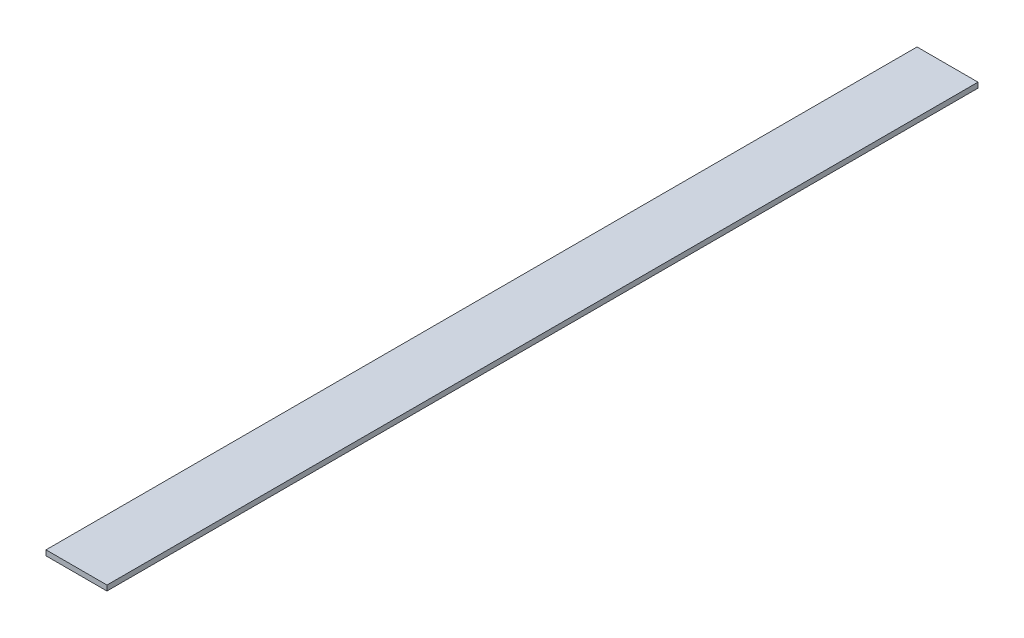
ISO-10303-21;
HEADER;
FILE_DESCRIPTION(('STEP AP214'),'2;1');
FILE_NAME('part.step','',(''),(''),'','','');
FILE_SCHEMA(('AUTOMOTIVE_DESIGN { 1 0 10303 214 1 1 1 1 }'));
ENDSEC;
DATA;
#1=APPLICATION_CONTEXT('core data for automotive mechanical design processes');
#2=APPLICATION_PROTOCOL_DEFINITION('international standard','automotive_design',2000,#1);
#3=PRODUCT_CONTEXT('',#1,'mechanical');
#4=PRODUCT('Part','Part','',(#3));
#5=PRODUCT_RELATED_PRODUCT_CATEGORY('part','',(#4));
#6=PRODUCT_DEFINITION_FORMATION('','',#4);
#7=PRODUCT_DEFINITION_CONTEXT('part definition',#1,'design');
#8=PRODUCT_DEFINITION('design','',#6,#7);
#9=PRODUCT_DEFINITION_SHAPE('','',#8);
#10=(LENGTH_UNIT() NAMED_UNIT(*) SI_UNIT(.MILLI.,.METRE.));
#11=(NAMED_UNIT(*) PLANE_ANGLE_UNIT() SI_UNIT($,.RADIAN.));
#12=(NAMED_UNIT(*) SI_UNIT($,.STERADIAN.) SOLID_ANGLE_UNIT());
#13=UNCERTAINTY_MEASURE_WITH_UNIT(LENGTH_MEASURE(1.E-05),#10,'distance_accuracy_value','');
#14=(GEOMETRIC_REPRESENTATION_CONTEXT(3) GLOBAL_UNCERTAINTY_ASSIGNED_CONTEXT((#13)) GLOBAL_UNIT_ASSIGNED_CONTEXT((#10,
#11,#12)) REPRESENTATION_CONTEXT('',''));
#15=CARTESIAN_POINT('',(0.,0.,0.));
#16=DIRECTION('',(0.,0.,1.));
#17=DIRECTION('',(1.,0.,0.));
#18=AXIS2_PLACEMENT_3D('',#15,#16,#17);
#19=CARTESIAN_POINT('',(17.5,0.,0.));
#20=DIRECTION('',(-1.,0.,0.));
#21=DIRECTION('',(0.,0.,1.));
#22=AXIS2_PLACEMENT_3D('',#19,#20,#21);
#23=PLANE('',#22);
#24=DIRECTION('',(0.,-1.,0.));
#25=VECTOR('',#24,1.);
#26=CARTESIAN_POINT('',(17.5,1.5,0.));
#27=LINE('',#26,#25);
#28=CARTESIAN_POINT('',(17.5,3.,0.));
#29=VERTEX_POINT('',#28);
#30=CARTESIAN_POINT('',(17.5,0.,0.));
#31=VERTEX_POINT('',#30);
#32=EDGE_CURVE('E51',#29,#31,#27,.T.);
#33=ORIENTED_EDGE('',*,*,#32,.F.);
#34=DIRECTION('',(0.,0.,-1.));
#35=VECTOR('',#34,1.);
#36=CARTESIAN_POINT('',(17.5,3.,250.));
#37=LINE('',#36,#35);
#38=CARTESIAN_POINT('',(17.5,3.,500.));
#39=VERTEX_POINT('',#38);
#40=EDGE_CURVE('E66',#39,#29,#37,.T.);
#41=ORIENTED_EDGE('',*,*,#40,.F.);
#42=DIRECTION('',(0.,-1.,0.));
#43=VECTOR('',#42,1.);
#44=CARTESIAN_POINT('',(17.5,1.5,500.));
#45=LINE('',#44,#43);
#46=CARTESIAN_POINT('',(17.5,0.,500.));
#47=VERTEX_POINT('',#46);
#48=EDGE_CURVE('E18',#39,#47,#45,.T.);
#49=ORIENTED_EDGE('',*,*,#48,.T.);
#50=DIRECTION('',(0.,0.,1.));
#51=VECTOR('',#50,1.);
#52=CARTESIAN_POINT('',(17.5,0.,250.));
#53=LINE('',#52,#51);
#54=EDGE_CURVE('E56',#31,#47,#53,.T.);
#55=ORIENTED_EDGE('',*,*,#54,.F.);
#56=EDGE_LOOP('',(#33,#41,#49,#55));
#57=FACE_BOUND('',#56,.T.);
#58=ADVANCED_FACE('F14',(#57),#23,.F.);
#59=CARTESIAN_POINT('',(17.5,0.,500.));
#60=DIRECTION('',(0.,0.,-1.));
#61=DIRECTION('',(-1.,0.,0.));
#62=AXIS2_PLACEMENT_3D('',#59,#60,#61);
#63=PLANE('',#62);
#64=DIRECTION('',(-1.,0.,0.));
#65=VECTOR('',#64,1.);
#66=CARTESIAN_POINT('',(0.,0.,500.));
#67=LINE('',#66,#65);
#68=CARTESIAN_POINT('',(-17.5,0.,500.));
#69=VERTEX_POINT('',#68);
#70=EDGE_CURVE('E61',#47,#69,#67,.T.);
#71=ORIENTED_EDGE('',*,*,#70,.F.);
#72=ORIENTED_EDGE('',*,*,#48,.F.);
#73=DIRECTION('',(1.,0.,0.));
#74=VECTOR('',#73,1.);
#75=CARTESIAN_POINT('',(0.,3.,500.));
#76=LINE('',#75,#74);
#77=CARTESIAN_POINT('',(-17.5,3.,500.));
#78=VERTEX_POINT('',#77);
#79=EDGE_CURVE('E79',#78,#39,#76,.T.);
#80=ORIENTED_EDGE('',*,*,#79,.F.);
#81=DIRECTION('',(0.,-1.,0.));
#82=VECTOR('',#81,1.);
#83=CARTESIAN_POINT('',(-17.5,1.5,500.));
#84=LINE('',#83,#82);
#85=EDGE_CURVE('E72',#78,#69,#84,.T.);
#86=ORIENTED_EDGE('',*,*,#85,.T.);
#87=EDGE_LOOP('',(#71,#72,#80,#86));
#88=FACE_BOUND('',#87,.T.);
#89=ADVANCED_FACE('F71',(#88),#63,.F.);
#90=CARTESIAN_POINT('',(-17.5,0.,500.));
#91=DIRECTION('',(0.,-1.,0.));
#92=DIRECTION('',(0.,0.,-1.));
#93=AXIS2_PLACEMENT_3D('',#90,#91,#92);
#94=PLANE('',#93);
#95=ORIENTED_EDGE('',*,*,#70,.T.);
#96=DIRECTION('',(0.,0.,-1.));
#97=VECTOR('',#96,1.);
#98=CARTESIAN_POINT('',(-17.5,0.,250.));
#99=LINE('',#98,#97);
#100=CARTESIAN_POINT('',(-17.5,0.,0.));
#101=VERTEX_POINT('',#100);
#102=EDGE_CURVE('E82',#69,#101,#99,.T.);
#103=ORIENTED_EDGE('',*,*,#102,.T.);
#104=DIRECTION('',(-1.,0.,0.));
#105=VECTOR('',#104,1.);
#106=CARTESIAN_POINT('',(0.,0.,0.));
#107=LINE('',#106,#105);
#108=EDGE_CURVE('E63',#31,#101,#107,.T.);
#109=ORIENTED_EDGE('',*,*,#108,.F.);
#110=ORIENTED_EDGE('',*,*,#54,.T.);
#111=EDGE_LOOP('',(#95,#103,#109,#110));
#112=FACE_BOUND('',#111,.T.);
#113=ADVANCED_FACE('F58',(#112),#94,.T.);
#114=CARTESIAN_POINT('',(17.5,0.,0.));
#115=DIRECTION('',(0.,0.,-1.));
#116=DIRECTION('',(-1.,0.,0.));
#117=AXIS2_PLACEMENT_3D('',#114,#115,#116);
#118=PLANE('',#117);
#119=ORIENTED_EDGE('',*,*,#32,.T.);
#120=ORIENTED_EDGE('',*,*,#108,.T.);
#121=DIRECTION('',(0.,1.,0.));
#122=VECTOR('',#121,1.);
#123=CARTESIAN_POINT('',(-17.5,1.5,0.));
#124=LINE('',#123,#122);
#125=CARTESIAN_POINT('',(-17.5,3.,0.));
#126=VERTEX_POINT('',#125);
#127=EDGE_CURVE('E24',#101,#126,#124,.T.);
#128=ORIENTED_EDGE('',*,*,#127,.T.);
#129=DIRECTION('',(-1.,0.,0.));
#130=VECTOR('',#129,1.);
#131=CARTESIAN_POINT('',(0.,3.,0.));
#132=LINE('',#131,#130);
#133=EDGE_CURVE('E32',#29,#126,#132,.T.);
#134=ORIENTED_EDGE('',*,*,#133,.F.);
#135=EDGE_LOOP('',(#119,#120,#128,#134));
#136=FACE_BOUND('',#135,.T.);
#137=ADVANCED_FACE('F86',(#136),#118,.T.);
#138=CARTESIAN_POINT('',(17.5,3.,0.));
#139=DIRECTION('',(0.,1.,0.));
#140=DIRECTION('',(-1.,0.,0.));
#141=AXIS2_PLACEMENT_3D('',#138,#139,#140);
#142=PLANE('',#141);
#143=DIRECTION('',(0.,0.,1.));
#144=VECTOR('',#143,1.);
#145=CARTESIAN_POINT('',(-17.5,3.,250.));
#146=LINE('',#145,#144);
#147=EDGE_CURVE('E9',#126,#78,#146,.T.);
#148=ORIENTED_EDGE('',*,*,#147,.T.);
#149=ORIENTED_EDGE('',*,*,#79,.T.);
#150=ORIENTED_EDGE('',*,*,#40,.T.);
#151=ORIENTED_EDGE('',*,*,#133,.T.);
#152=EDGE_LOOP('',(#148,#149,#150,#151));
#153=FACE_BOUND('',#152,.T.);
#154=ADVANCED_FACE('F88',(#153),#142,.T.);
#155=CARTESIAN_POINT('',(-17.5,0.,500.));
#156=DIRECTION('',(1.,0.,0.));
#157=DIRECTION('',(0.,0.,-1.));
#158=AXIS2_PLACEMENT_3D('',#155,#156,#157);
#159=PLANE('',#158);
#160=ORIENTED_EDGE('',*,*,#127,.F.);
#161=ORIENTED_EDGE('',*,*,#102,.F.);
#162=ORIENTED_EDGE('',*,*,#85,.F.);
#163=ORIENTED_EDGE('',*,*,#147,.F.);
#164=EDGE_LOOP('',(#160,#161,#162,#163));
#165=FACE_BOUND('',#164,.T.);
#166=ADVANCED_FACE('F16',(#165),#159,.F.);
#167=CLOSED_SHELL('',(#58,#89,#113,#137,#154,#166));
#168=MANIFOLD_SOLID_BREP('B1',#167);
#169=ADVANCED_BREP_SHAPE_REPRESENTATION('',(#18,#168),#14);
#170=SHAPE_DEFINITION_REPRESENTATION(#9,#169);
ENDSEC;
END-ISO-10303-21;
